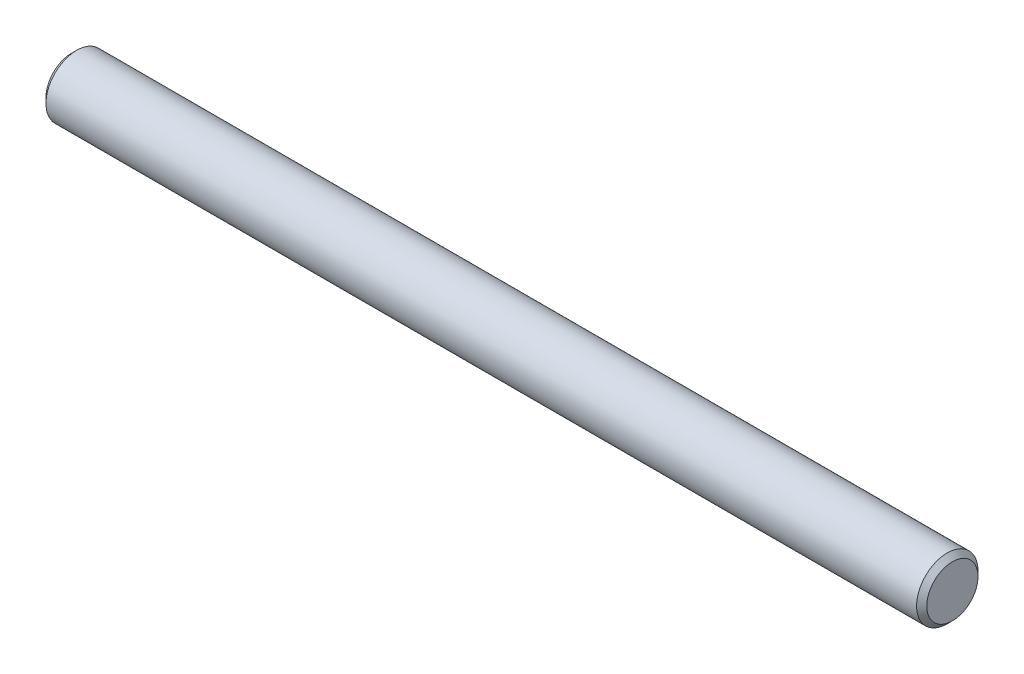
ISO-10303-21;
HEADER;
FILE_DESCRIPTION(('STEP AP214'),'2;1');
FILE_NAME('part.step','',(''),(''),'','','');
FILE_SCHEMA(('AUTOMOTIVE_DESIGN { 1 0 10303 214 1 1 1 1 }'));
ENDSEC;
DATA;
#1=APPLICATION_CONTEXT('core data for automotive mechanical design processes');
#2=APPLICATION_PROTOCOL_DEFINITION('international standard','automotive_design',2000,#1);
#3=PRODUCT_CONTEXT('',#1,'mechanical');
#4=PRODUCT('Part','Part','',(#3));
#5=PRODUCT_RELATED_PRODUCT_CATEGORY('part','',(#4));
#6=PRODUCT_DEFINITION_FORMATION('','',#4);
#7=PRODUCT_DEFINITION_CONTEXT('part definition',#1,'design');
#8=PRODUCT_DEFINITION('design','',#6,#7);
#9=PRODUCT_DEFINITION_SHAPE('','',#8);
#10=(LENGTH_UNIT() NAMED_UNIT(*) SI_UNIT(.MILLI.,.METRE.));
#11=(NAMED_UNIT(*) PLANE_ANGLE_UNIT() SI_UNIT($,.RADIAN.));
#12=(NAMED_UNIT(*) SI_UNIT($,.STERADIAN.) SOLID_ANGLE_UNIT());
#13=UNCERTAINTY_MEASURE_WITH_UNIT(LENGTH_MEASURE(1.E-05),#10,'distance_accuracy_value','');
#14=(GEOMETRIC_REPRESENTATION_CONTEXT(3) GLOBAL_UNCERTAINTY_ASSIGNED_CONTEXT((#13)) GLOBAL_UNIT_ASSIGNED_CONTEXT((#10,
#11,#12)) REPRESENTATION_CONTEXT('',''));
#15=CARTESIAN_POINT('',(0.,0.,0.));
#16=DIRECTION('',(0.,0.,1.));
#17=DIRECTION('',(1.,0.,0.));
#18=AXIS2_PLACEMENT_3D('',#15,#16,#17);
#19=CARTESIAN_POINT('',(172.,0.,0.));
#20=DIRECTION('',(-1.,0.,0.));
#21=DIRECTION('',(0.,0.,1.));
#22=AXIS2_PLACEMENT_3D('',#19,#20,#21);
#23=CYLINDRICAL_SURFACE('',#22,6.);
#24=CARTESIAN_POINT('',(171.,0.,0.));
#25=DIRECTION('',(1.,0.,0.));
#26=DIRECTION('',(0.,0.,-1.));
#27=AXIS2_PLACEMENT_3D('',#24,#25,#26);
#28=CIRCLE('',#27,6.);
#29=CARTESIAN_POINT('',(171.,0.,-6.));
#30=VERTEX_POINT('',#29);
#31=EDGE_CURVE('E352',#30,#30,#28,.F.);
#32=ORIENTED_EDGE('',*,*,#31,.T.);
#33=EDGE_LOOP('',(#32));
#34=FACE_BOUND('',#33,.T.);
#35=CARTESIAN_POINT('',(1.,0.,0.));
#36=DIRECTION('',(1.,0.,0.));
#37=DIRECTION('',(0.,0.,-1.));
#38=AXIS2_PLACEMENT_3D('',#35,#36,#37);
#39=CIRCLE('',#38,6.);
#40=CARTESIAN_POINT('',(1.,0.,-6.));
#41=VERTEX_POINT('',#40);
#42=EDGE_CURVE('E356',#41,#41,#39,.T.);
#43=ORIENTED_EDGE('',*,*,#42,.T.);
#44=EDGE_LOOP('',(#43));
#45=FACE_BOUND('',#44,.T.);
#46=ADVANCED_FACE('F346',(#34,#45),#23,.T.);
#47=CARTESIAN_POINT('',(172.,0.,0.));
#48=DIRECTION('',(1.,0.,0.));
#49=DIRECTION('',(0.,0.,-1.));
#50=AXIS2_PLACEMENT_3D('',#47,#48,#49);
#51=PLANE('',#50);
#52=CARTESIAN_POINT('',(172.,0.,0.));
#53=DIRECTION('',(1.,0.,0.));
#54=DIRECTION('',(0.,0.,-1.));
#55=AXIS2_PLACEMENT_3D('',#52,#53,#54);
#56=CIRCLE('',#55,5.);
#57=CARTESIAN_POINT('',(172.,0.,-5.));
#58=VERTEX_POINT('',#57);
#59=EDGE_CURVE('E360',#58,#58,#56,.T.);
#60=ORIENTED_EDGE('',*,*,#59,.T.);
#61=EDGE_LOOP('',(#60));
#62=FACE_BOUND('',#61,.T.);
#63=ADVANCED_FACE('F366',(#62),#51,.T.);
#64=CARTESIAN_POINT('',(0.,0.,0.));
#65=DIRECTION('',(1.,0.,0.));
#66=DIRECTION('',(0.,0.,-1.));
#67=AXIS2_PLACEMENT_3D('',#64,#65,#66);
#68=PLANE('',#67);
#69=CARTESIAN_POINT('',(0.,0.,0.));
#70=DIRECTION('',(1.,0.,0.));
#71=DIRECTION('',(0.,0.,-1.));
#72=AXIS2_PLACEMENT_3D('',#69,#70,#71);
#73=CIRCLE('',#72,4.99999999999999);
#74=CARTESIAN_POINT('',(0.,0.,-4.99999999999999));
#75=VERTEX_POINT('',#74);
#76=EDGE_CURVE('E10',#75,#75,#73,.F.);
#77=ORIENTED_EDGE('',*,*,#76,.T.);
#78=EDGE_LOOP('',(#77));
#79=FACE_BOUND('',#78,.T.);
#80=ADVANCED_FACE('F371',(#79),#68,.F.);
#81=CARTESIAN_POINT('',(172.,0.,0.));
#82=DIRECTION('',(-1.,0.,0.));
#83=DIRECTION('',(0.,0.,1.));
#84=AXIS2_PLACEMENT_3D('',#81,#82,#83);
#85=CONICAL_SURFACE('',#84,5.,0.785398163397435);
#86=ORIENTED_EDGE('',*,*,#31,.F.);
#87=EDGE_LOOP('',(#86));
#88=FACE_BOUND('',#87,.T.);
#89=ORIENTED_EDGE('',*,*,#59,.F.);
#90=EDGE_LOOP('',(#89));
#91=FACE_BOUND('',#90,.T.);
#92=ADVANCED_FACE('F368',(#88,#91),#85,.T.);
#93=CARTESIAN_POINT('',(1.,0.,0.));
#94=DIRECTION('',(1.,0.,0.));
#95=DIRECTION('',(0.,0.,-1.));
#96=AXIS2_PLACEMENT_3D('',#93,#94,#95);
#97=CONICAL_SURFACE('',#96,6.,0.785398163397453);
#98=ORIENTED_EDGE('',*,*,#76,.F.);
#99=EDGE_LOOP('',(#98));
#100=FACE_BOUND('',#99,.T.);
#101=ORIENTED_EDGE('',*,*,#42,.F.);
#102=EDGE_LOOP('',(#101));
#103=FACE_BOUND('',#102,.T.);
#104=ADVANCED_FACE('F370',(#100,#103),#97,.T.);
#105=CLOSED_SHELL('',(#46,#63,#80,#92,#104));
#106=MANIFOLD_SOLID_BREP('B2',#105);
#107=ADVANCED_BREP_SHAPE_REPRESENTATION('',(#18,#106),#14);
#108=SHAPE_DEFINITION_REPRESENTATION(#9,#107);
ENDSEC;
END-ISO-10303-21;
